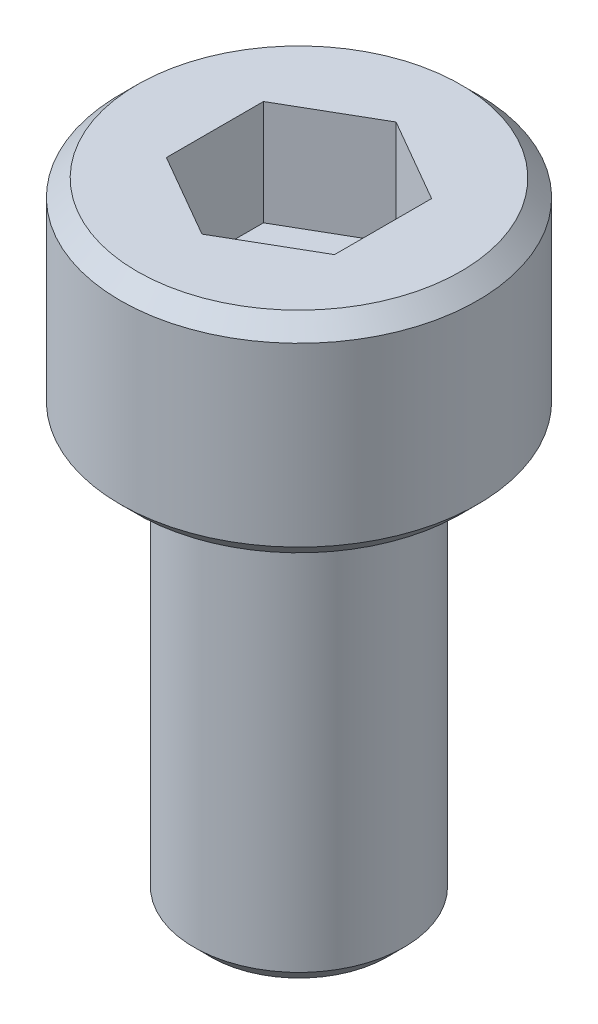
from build123d import *

# Parameters (mm, degrees)
CHANFREIN1_SIZE         = 0.4
ENL_V_MAT_EXTRU_1_DEPTH = 2.5


with BuildPart() as part:
    # Esquisse1 → R_volution1 (revolve)
    with BuildSketch(Plane.XY, mode=Mode.PRIVATE) as r_volution1_sk:
        Polygon((0, 0), (2.5, 0), (2.5, 10), (4.25, 10), (4.25, 15), (0, 15), align=None)
    revolve(r_volution1_sk.sketch.rotate(Axis((0, 0, 0), (0, 1, 0)), 90), axis=Axis((0, 0, 0), (0, 1, 0)))

    # Chanfrein1
    chanfrein1_edges = [part.edges().sort_by_distance(p)[0] for p in [
        (0, 0, 2.5),
        (0, 10, 4.25),
        (0, 15, 4.25),
    ]]
    chamfer(chanfrein1_edges, length=CHANFREIN1_SIZE)

    # Esquisse2 → Enl_v. mat.-Extru.1 (cut)
    with BuildSketch(Plane(origin=(0, 15, 0), x_dir=(-1, 0, 0), z_dir=(0, 1, 0))):
        Polygon((-2, 1.154700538), (-2, -1.154700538), (0, -2.309401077), (2, -1.154700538), (2, 1.154700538), (0, 2.309401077), align=None)
    extrude(amount=-ENL_V_MAT_EXTRU_1_DEPTH, mode=Mode.SUBTRACT)


solid = part.part
